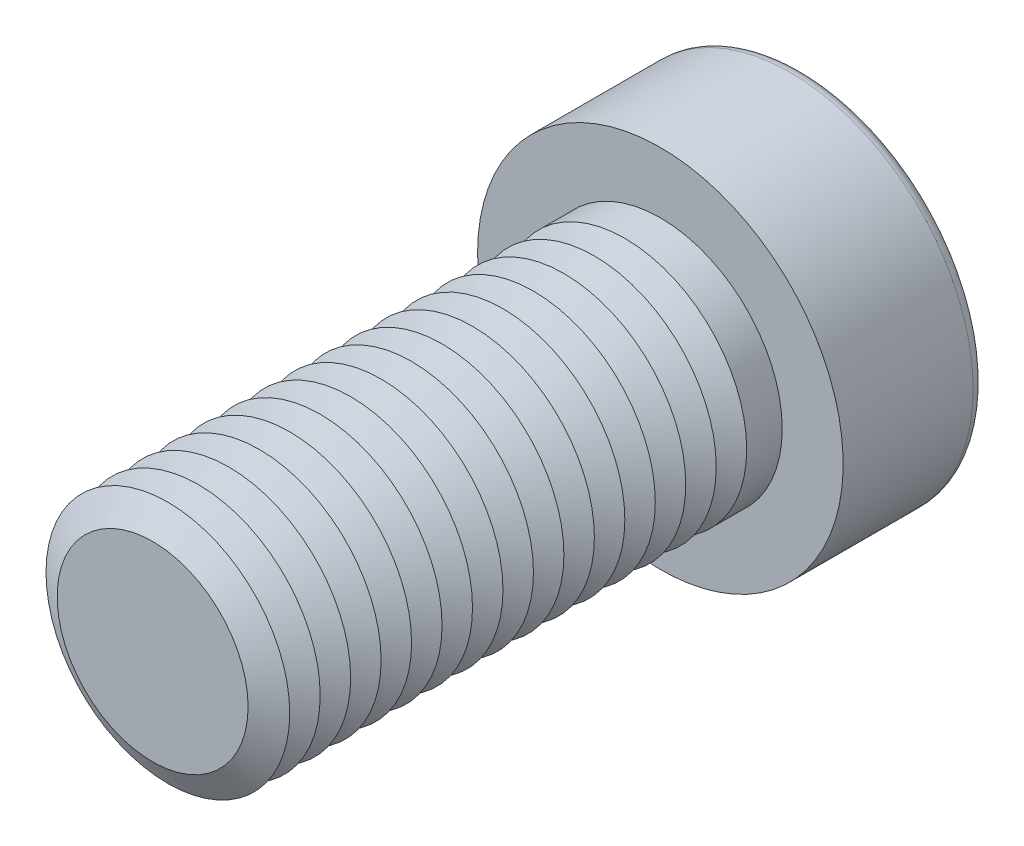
ISO-10303-21;
HEADER;
FILE_DESCRIPTION(('STEP AP214'),'2;1');
FILE_NAME('part.step','',(''),(''),'','','');
FILE_SCHEMA(('AUTOMOTIVE_DESIGN { 1 0 10303 214 1 1 1 1 }'));
ENDSEC;
DATA;
#1=APPLICATION_CONTEXT('core data for automotive mechanical design processes');
#2=APPLICATION_PROTOCOL_DEFINITION('international standard','automotive_design',2000,#1);
#3=PRODUCT_CONTEXT('',#1,'mechanical');
#4=PRODUCT('Part','Part','',(#3));
#5=PRODUCT_RELATED_PRODUCT_CATEGORY('part','',(#4));
#6=PRODUCT_DEFINITION_FORMATION('','',#4);
#7=PRODUCT_DEFINITION_CONTEXT('part definition',#1,'design');
#8=PRODUCT_DEFINITION('design','',#6,#7);
#9=PRODUCT_DEFINITION_SHAPE('','',#8);
#10=(LENGTH_UNIT() NAMED_UNIT(*) SI_UNIT(.MILLI.,.METRE.));
#11=(NAMED_UNIT(*) PLANE_ANGLE_UNIT() SI_UNIT($,.RADIAN.));
#12=(NAMED_UNIT(*) SI_UNIT($,.STERADIAN.) SOLID_ANGLE_UNIT());
#13=UNCERTAINTY_MEASURE_WITH_UNIT(LENGTH_MEASURE(1.E-05),#10,'distance_accuracy_value','');
#14=(GEOMETRIC_REPRESENTATION_CONTEXT(3) GLOBAL_UNCERTAINTY_ASSIGNED_CONTEXT((#13)) GLOBAL_UNIT_ASSIGNED_CONTEXT((#10,
#11,#12)) REPRESENTATION_CONTEXT('',''));
#15=CARTESIAN_POINT('',(0.,0.,0.));
#16=DIRECTION('',(0.,0.,1.));
#17=DIRECTION('',(1.,0.,0.));
#18=AXIS2_PLACEMENT_3D('',#15,#16,#17);
#19=CARTESIAN_POINT('',(0.,0.,39.5));
#20=DIRECTION('',(0.,0.,1.));
#21=DIRECTION('',(1.,0.,0.));
#22=AXIS2_PLACEMENT_3D('',#19,#20,#21);
#23=CONICAL_SURFACE('',#22,12.,1.0471975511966);
#24=CARTESIAN_POINT('',(0.,0.,38.));
#25=DIRECTION('',(0.,0.,1.));
#26=DIRECTION('',(1.,0.,0.));
#27=AXIS2_PLACEMENT_3D('',#24,#25,#26);
#28=CIRCLE('',#27,9.40192378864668);
#29=CARTESIAN_POINT('',(9.40192378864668,0.,38.));
#30=VERTEX_POINT('',#29);
#31=EDGE_CURVE('E314',#30,#30,#28,.T.);
#32=ORIENTED_EDGE('',*,*,#31,.T.);
#33=EDGE_LOOP('',(#32));
#34=FACE_BOUND('',#33,.T.);
#35=CARTESIAN_POINT('',(0.,0.,39.5));
#36=DIRECTION('',(0.,0.,1.));
#37=DIRECTION('',(1.,0.,0.));
#38=AXIS2_PLACEMENT_3D('',#35,#36,#37);
#39=CIRCLE('',#38,12.);
#40=CARTESIAN_POINT('',(12.,0.,39.5));
#41=VERTEX_POINT('',#40);
#42=EDGE_CURVE('E317',#41,#41,#39,.T.);
#43=ORIENTED_EDGE('',*,*,#42,.F.);
#44=EDGE_LOOP('',(#43));
#45=FACE_BOUND('',#44,.T.);
#46=ADVANCED_FACE('F39',(#34,#45),#23,.T.);
#47=CARTESIAN_POINT('',(0.,0.,38.));
#48=DIRECTION('',(0.,0.,-1.));
#49=DIRECTION('',(-1.,0.,0.));
#50=AXIS2_PLACEMENT_3D('',#47,#48,#49);
#51=CONICAL_SURFACE('',#50,9.40192378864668,1.0471975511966);
#52=CARTESIAN_POINT('',(0.,0.,36.5));
#53=DIRECTION('',(0.,0.,1.));
#54=DIRECTION('',(1.,0.,0.));
#55=AXIS2_PLACEMENT_3D('',#52,#53,#54);
#56=CIRCLE('',#55,12.);
#57=CARTESIAN_POINT('',(12.,0.,36.5));
#58=VERTEX_POINT('',#57);
#59=EDGE_CURVE('E325',#58,#58,#56,.T.);
#60=ORIENTED_EDGE('',*,*,#59,.T.);
#61=EDGE_LOOP('',(#60));
#62=FACE_BOUND('',#61,.T.);
#63=ORIENTED_EDGE('',*,*,#31,.F.);
#64=EDGE_LOOP('',(#63));
#65=FACE_BOUND('',#64,.T.);
#66=ADVANCED_FACE('F245',(#62,#65),#51,.T.);
#67=CARTESIAN_POINT('',(0.,0.,50.));
#68=DIRECTION('',(0.,0.,1.));
#69=DIRECTION('',(1.,0.,0.));
#70=AXIS2_PLACEMENT_3D('',#67,#68,#69);
#71=PLANE('',#70);
#72=CARTESIAN_POINT('',(0.,0.,50.));
#73=DIRECTION('',(0.,0.,1.));
#74=DIRECTION('',(1.,0.,0.));
#75=AXIS2_PLACEMENT_3D('',#72,#73,#74);
#76=CIRCLE('',#75,9.40192378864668);
#77=CARTESIAN_POINT('',(9.40192378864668,0.,50.));
#78=VERTEX_POINT('',#77);
#79=EDGE_CURVE('E174',#78,#78,#76,.T.);
#80=ORIENTED_EDGE('',*,*,#79,.T.);
#81=EDGE_LOOP('',(#80));
#82=FACE_BOUND('',#81,.T.);
#83=ADVANCED_FACE('F251',(#82),#71,.T.);
#84=CARTESIAN_POINT('',(0.,0.,50.));
#85=DIRECTION('',(0.,0.,-1.));
#86=DIRECTION('',(-1.,0.,0.));
#87=AXIS2_PLACEMENT_3D('',#84,#85,#86);
#88=CONICAL_SURFACE('',#87,9.40192378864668,1.0471975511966);
#89=CARTESIAN_POINT('',(0.,0.,48.5));
#90=DIRECTION('',(0.,0.,1.));
#91=DIRECTION('',(1.,0.,0.));
#92=AXIS2_PLACEMENT_3D('',#89,#90,#91);
#93=CIRCLE('',#92,12.);
#94=CARTESIAN_POINT('',(12.,0.,48.5));
#95=VERTEX_POINT('',#94);
#96=EDGE_CURVE('E291',#95,#95,#93,.T.);
#97=ORIENTED_EDGE('',*,*,#96,.T.);
#98=EDGE_LOOP('',(#97));
#99=FACE_BOUND('',#98,.T.);
#100=ORIENTED_EDGE('',*,*,#79,.F.);
#101=EDGE_LOOP('',(#100));
#102=FACE_BOUND('',#101,.T.);
#103=ADVANCED_FACE('F199',(#99,#102),#88,.T.);
#104=CARTESIAN_POINT('',(0.,0.,48.5));
#105=DIRECTION('',(0.,0.,1.));
#106=DIRECTION('',(1.,0.,0.));
#107=AXIS2_PLACEMENT_3D('',#104,#105,#106);
#108=CONICAL_SURFACE('',#107,12.,1.0471975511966);
#109=CARTESIAN_POINT('',(0.,0.,47.));
#110=DIRECTION('',(0.,0.,1.));
#111=DIRECTION('',(1.,0.,0.));
#112=AXIS2_PLACEMENT_3D('',#109,#110,#111);
#113=CIRCLE('',#112,9.40192378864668);
#114=CARTESIAN_POINT('',(9.40192378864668,0.,47.));
#115=VERTEX_POINT('',#114);
#116=EDGE_CURVE('E288',#115,#115,#113,.T.);
#117=ORIENTED_EDGE('',*,*,#116,.T.);
#118=EDGE_LOOP('',(#117));
#119=FACE_BOUND('',#118,.T.);
#120=ORIENTED_EDGE('',*,*,#96,.F.);
#121=EDGE_LOOP('',(#120));
#122=FACE_BOUND('',#121,.T.);
#123=ADVANCED_FACE('F277',(#119,#122),#108,.T.);
#124=CARTESIAN_POINT('',(0.,0.,47.));
#125=DIRECTION('',(0.,0.,-1.));
#126=DIRECTION('',(-1.,0.,0.));
#127=AXIS2_PLACEMENT_3D('',#124,#125,#126);
#128=CONICAL_SURFACE('',#127,9.40192378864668,1.0471975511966);
#129=CARTESIAN_POINT('',(0.,0.,45.5));
#130=DIRECTION('',(0.,0.,1.));
#131=DIRECTION('',(1.,0.,0.));
#132=AXIS2_PLACEMENT_3D('',#129,#130,#131);
#133=CIRCLE('',#132,12.);
#134=CARTESIAN_POINT('',(12.,0.,45.5));
#135=VERTEX_POINT('',#134);
#136=EDGE_CURVE('E300',#135,#135,#133,.T.);
#137=ORIENTED_EDGE('',*,*,#136,.T.);
#138=EDGE_LOOP('',(#137));
#139=FACE_BOUND('',#138,.T.);
#140=ORIENTED_EDGE('',*,*,#116,.F.);
#141=EDGE_LOOP('',(#140));
#142=FACE_BOUND('',#141,.T.);
#143=ADVANCED_FACE('F274',(#139,#142),#128,.T.);
#144=CARTESIAN_POINT('',(0.,0.,45.5));
#145=DIRECTION('',(0.,0.,1.));
#146=DIRECTION('',(1.,0.,0.));
#147=AXIS2_PLACEMENT_3D('',#144,#145,#146);
#148=CONICAL_SURFACE('',#147,12.,1.0471975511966);
#149=CARTESIAN_POINT('',(0.,0.,44.));
#150=DIRECTION('',(0.,0.,1.));
#151=DIRECTION('',(1.,0.,0.));
#152=AXIS2_PLACEMENT_3D('',#149,#150,#151);
#153=CIRCLE('',#152,9.40192378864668);
#154=CARTESIAN_POINT('',(9.40192378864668,0.,44.));
#155=VERTEX_POINT('',#154);
#156=EDGE_CURVE('E293',#155,#155,#153,.T.);
#157=ORIENTED_EDGE('',*,*,#156,.T.);
#158=EDGE_LOOP('',(#157));
#159=FACE_BOUND('',#158,.T.);
#160=ORIENTED_EDGE('',*,*,#136,.F.);
#161=EDGE_LOOP('',(#160));
#162=FACE_BOUND('',#161,.T.);
#163=ADVANCED_FACE('F270',(#159,#162),#148,.T.);
#164=CARTESIAN_POINT('',(0.,0.,44.));
#165=DIRECTION('',(0.,0.,-1.));
#166=DIRECTION('',(-1.,0.,0.));
#167=AXIS2_PLACEMENT_3D('',#164,#165,#166);
#168=CONICAL_SURFACE('',#167,9.40192378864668,1.0471975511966);
#169=CARTESIAN_POINT('',(0.,0.,42.5));
#170=DIRECTION('',(0.,0.,1.));
#171=DIRECTION('',(1.,0.,0.));
#172=AXIS2_PLACEMENT_3D('',#169,#170,#171);
#173=CIRCLE('',#172,12.);
#174=CARTESIAN_POINT('',(12.,0.,42.5));
#175=VERTEX_POINT('',#174);
#176=EDGE_CURVE('E310',#175,#175,#173,.T.);
#177=ORIENTED_EDGE('',*,*,#176,.T.);
#178=EDGE_LOOP('',(#177));
#179=FACE_BOUND('',#178,.T.);
#180=ORIENTED_EDGE('',*,*,#156,.F.);
#181=EDGE_LOOP('',(#180));
#182=FACE_BOUND('',#181,.T.);
#183=ADVANCED_FACE('F266',(#179,#182),#168,.T.);
#184=CARTESIAN_POINT('',(0.,0.,42.5));
#185=DIRECTION('',(0.,0.,1.));
#186=DIRECTION('',(1.,0.,0.));
#187=AXIS2_PLACEMENT_3D('',#184,#185,#186);
#188=CONICAL_SURFACE('',#187,12.,1.0471975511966);
#189=CARTESIAN_POINT('',(0.,0.,41.));
#190=DIRECTION('',(0.,0.,1.));
#191=DIRECTION('',(1.,0.,0.));
#192=AXIS2_PLACEMENT_3D('',#189,#190,#191);
#193=CIRCLE('',#192,9.40192378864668);
#194=CARTESIAN_POINT('',(9.40192378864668,0.,41.));
#195=VERTEX_POINT('',#194);
#196=EDGE_CURVE('E306',#195,#195,#193,.T.);
#197=ORIENTED_EDGE('',*,*,#196,.T.);
#198=EDGE_LOOP('',(#197));
#199=FACE_BOUND('',#198,.T.);
#200=ORIENTED_EDGE('',*,*,#176,.F.);
#201=EDGE_LOOP('',(#200));
#202=FACE_BOUND('',#201,.T.);
#203=ADVANCED_FACE('F262',(#199,#202),#188,.T.);
#204=CARTESIAN_POINT('',(0.,0.,41.));
#205=DIRECTION('',(0.,0.,-1.));
#206=DIRECTION('',(-1.,0.,0.));
#207=AXIS2_PLACEMENT_3D('',#204,#205,#206);
#208=CONICAL_SURFACE('',#207,9.40192378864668,1.0471975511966);
#209=ORIENTED_EDGE('',*,*,#42,.T.);
#210=EDGE_LOOP('',(#209));
#211=FACE_BOUND('',#210,.T.);
#212=ORIENTED_EDGE('',*,*,#196,.F.);
#213=EDGE_LOOP('',(#212));
#214=FACE_BOUND('',#213,.T.);
#215=ADVANCED_FACE('F258',(#211,#214),#208,.T.);
#216=CARTESIAN_POINT('',(0.,0.,36.5));
#217=DIRECTION('',(0.,0.,1.));
#218=DIRECTION('',(1.,0.,0.));
#219=AXIS2_PLACEMENT_3D('',#216,#217,#218);
#220=CONICAL_SURFACE('',#219,12.,1.0471975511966);
#221=CARTESIAN_POINT('',(0.,0.,35.));
#222=DIRECTION('',(0.,0.,1.));
#223=DIRECTION('',(1.,0.,0.));
#224=AXIS2_PLACEMENT_3D('',#221,#222,#223);
#225=CIRCLE('',#224,9.40192378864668);
#226=CARTESIAN_POINT('',(9.40192378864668,0.,35.));
#227=VERTEX_POINT('',#226);
#228=EDGE_CURVE('E321',#227,#227,#225,.T.);
#229=ORIENTED_EDGE('',*,*,#228,.T.);
#230=EDGE_LOOP('',(#229));
#231=FACE_BOUND('',#230,.T.);
#232=ORIENTED_EDGE('',*,*,#59,.F.);
#233=EDGE_LOOP('',(#232));
#234=FACE_BOUND('',#233,.T.);
#235=ADVANCED_FACE('F261',(#231,#234),#220,.T.);
#236=CARTESIAN_POINT('',(0.,0.,35.));
#237=DIRECTION('',(0.,0.,-1.));
#238=DIRECTION('',(-1.,0.,0.));
#239=AXIS2_PLACEMENT_3D('',#236,#237,#238);
#240=CONICAL_SURFACE('',#239,9.40192378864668,1.0471975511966);
#241=CARTESIAN_POINT('',(0.,0.,33.5));
#242=DIRECTION('',(0.,0.,1.));
#243=DIRECTION('',(1.,0.,0.));
#244=AXIS2_PLACEMENT_3D('',#241,#242,#243);
#245=CIRCLE('',#244,12.);
#246=CARTESIAN_POINT('',(12.,0.,33.5));
#247=VERTEX_POINT('',#246);
#248=EDGE_CURVE('E333',#247,#247,#245,.T.);
#249=ORIENTED_EDGE('',*,*,#248,.T.);
#250=EDGE_LOOP('',(#249));
#251=FACE_BOUND('',#250,.T.);
#252=ORIENTED_EDGE('',*,*,#228,.F.);
#253=EDGE_LOOP('',(#252));
#254=FACE_BOUND('',#253,.T.);
#255=ADVANCED_FACE('F498',(#251,#254),#240,.T.);
#256=CARTESIAN_POINT('',(0.,0.,33.5));
#257=DIRECTION('',(0.,0.,1.));
#258=DIRECTION('',(1.,0.,0.));
#259=AXIS2_PLACEMENT_3D('',#256,#257,#258);
#260=CONICAL_SURFACE('',#259,12.,1.0471975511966);
#261=CARTESIAN_POINT('',(0.,0.,32.));
#262=DIRECTION('',(0.,0.,1.));
#263=DIRECTION('',(1.,0.,0.));
#264=AXIS2_PLACEMENT_3D('',#261,#262,#263);
#265=CIRCLE('',#264,9.40192378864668);
#266=CARTESIAN_POINT('',(9.40192378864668,0.,32.));
#267=VERTEX_POINT('',#266);
#268=EDGE_CURVE('E329',#267,#267,#265,.T.);
#269=ORIENTED_EDGE('',*,*,#268,.T.);
#270=EDGE_LOOP('',(#269));
#271=FACE_BOUND('',#270,.T.);
#272=ORIENTED_EDGE('',*,*,#248,.F.);
#273=EDGE_LOOP('',(#272));
#274=FACE_BOUND('',#273,.T.);
#275=ADVANCED_FACE('F494',(#271,#274),#260,.T.);
#276=CARTESIAN_POINT('',(0.,0.,32.));
#277=DIRECTION('',(0.,0.,-1.));
#278=DIRECTION('',(-1.,0.,0.));
#279=AXIS2_PLACEMENT_3D('',#276,#277,#278);
#280=CONICAL_SURFACE('',#279,9.40192378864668,1.0471975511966);
#281=CARTESIAN_POINT('',(0.,0.,30.5));
#282=DIRECTION('',(0.,0.,1.));
#283=DIRECTION('',(1.,0.,0.));
#284=AXIS2_PLACEMENT_3D('',#281,#282,#283);
#285=CIRCLE('',#284,12.);
#286=CARTESIAN_POINT('',(12.,0.,30.5));
#287=VERTEX_POINT('',#286);
#288=EDGE_CURVE('E341',#287,#287,#285,.T.);
#289=ORIENTED_EDGE('',*,*,#288,.T.);
#290=EDGE_LOOP('',(#289));
#291=FACE_BOUND('',#290,.T.);
#292=ORIENTED_EDGE('',*,*,#268,.F.);
#293=EDGE_LOOP('',(#292));
#294=FACE_BOUND('',#293,.T.);
#295=ADVANCED_FACE('F490',(#291,#294),#280,.T.);
#296=CARTESIAN_POINT('',(0.,0.,30.5));
#297=DIRECTION('',(0.,0.,1.));
#298=DIRECTION('',(1.,0.,0.));
#299=AXIS2_PLACEMENT_3D('',#296,#297,#298);
#300=CONICAL_SURFACE('',#299,12.,1.0471975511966);
#301=CARTESIAN_POINT('',(0.,0.,29.));
#302=DIRECTION('',(0.,0.,1.));
#303=DIRECTION('',(1.,0.,0.));
#304=AXIS2_PLACEMENT_3D('',#301,#302,#303);
#305=CIRCLE('',#304,9.40192378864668);
#306=CARTESIAN_POINT('',(9.40192378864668,0.,29.));
#307=VERTEX_POINT('',#306);
#308=EDGE_CURVE('E337',#307,#307,#305,.T.);
#309=ORIENTED_EDGE('',*,*,#308,.T.);
#310=EDGE_LOOP('',(#309));
#311=FACE_BOUND('',#310,.T.);
#312=ORIENTED_EDGE('',*,*,#288,.F.);
#313=EDGE_LOOP('',(#312));
#314=FACE_BOUND('',#313,.T.);
#315=ADVANCED_FACE('F486',(#311,#314),#300,.T.);
#316=CARTESIAN_POINT('',(0.,0.,29.));
#317=DIRECTION('',(0.,0.,-1.));
#318=DIRECTION('',(-1.,0.,0.));
#319=AXIS2_PLACEMENT_3D('',#316,#317,#318);
#320=CONICAL_SURFACE('',#319,9.40192378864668,1.0471975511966);
#321=CARTESIAN_POINT('',(0.,0.,27.5));
#322=DIRECTION('',(0.,0.,1.));
#323=DIRECTION('',(1.,0.,0.));
#324=AXIS2_PLACEMENT_3D('',#321,#322,#323);
#325=CIRCLE('',#324,12.);
#326=CARTESIAN_POINT('',(12.,0.,27.5));
#327=VERTEX_POINT('',#326);
#328=EDGE_CURVE('E349',#327,#327,#325,.T.);
#329=ORIENTED_EDGE('',*,*,#328,.T.);
#330=EDGE_LOOP('',(#329));
#331=FACE_BOUND('',#330,.T.);
#332=ORIENTED_EDGE('',*,*,#308,.F.);
#333=EDGE_LOOP('',(#332));
#334=FACE_BOUND('',#333,.T.);
#335=ADVANCED_FACE('F482',(#331,#334),#320,.T.);
#336=CARTESIAN_POINT('',(0.,0.,27.5));
#337=DIRECTION('',(0.,0.,1.));
#338=DIRECTION('',(1.,0.,0.));
#339=AXIS2_PLACEMENT_3D('',#336,#337,#338);
#340=CONICAL_SURFACE('',#339,12.,1.0471975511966);
#341=CARTESIAN_POINT('',(0.,0.,26.));
#342=DIRECTION('',(0.,0.,1.));
#343=DIRECTION('',(1.,0.,0.));
#344=AXIS2_PLACEMENT_3D('',#341,#342,#343);
#345=CIRCLE('',#344,9.40192378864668);
#346=CARTESIAN_POINT('',(9.40192378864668,0.,26.));
#347=VERTEX_POINT('',#346);
#348=EDGE_CURVE('E345',#347,#347,#345,.T.);
#349=ORIENTED_EDGE('',*,*,#348,.T.);
#350=EDGE_LOOP('',(#349));
#351=FACE_BOUND('',#350,.T.);
#352=ORIENTED_EDGE('',*,*,#328,.F.);
#353=EDGE_LOOP('',(#352));
#354=FACE_BOUND('',#353,.T.);
#355=ADVANCED_FACE('F478',(#351,#354),#340,.T.);
#356=CARTESIAN_POINT('',(0.,0.,26.));
#357=DIRECTION('',(0.,0.,-1.));
#358=DIRECTION('',(-1.,0.,0.));
#359=AXIS2_PLACEMENT_3D('',#356,#357,#358);
#360=CONICAL_SURFACE('',#359,9.40192378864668,1.0471975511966);
#361=CARTESIAN_POINT('',(0.,0.,24.5));
#362=DIRECTION('',(0.,0.,1.));
#363=DIRECTION('',(1.,0.,0.));
#364=AXIS2_PLACEMENT_3D('',#361,#362,#363);
#365=CIRCLE('',#364,12.);
#366=CARTESIAN_POINT('',(12.,0.,24.5));
#367=VERTEX_POINT('',#366);
#368=EDGE_CURVE('E357',#367,#367,#365,.T.);
#369=ORIENTED_EDGE('',*,*,#368,.T.);
#370=EDGE_LOOP('',(#369));
#371=FACE_BOUND('',#370,.T.);
#372=ORIENTED_EDGE('',*,*,#348,.F.);
#373=EDGE_LOOP('',(#372));
#374=FACE_BOUND('',#373,.T.);
#375=ADVANCED_FACE('F474',(#371,#374),#360,.T.);
#376=CARTESIAN_POINT('',(0.,0.,24.5));
#377=DIRECTION('',(0.,0.,1.));
#378=DIRECTION('',(1.,0.,0.));
#379=AXIS2_PLACEMENT_3D('',#376,#377,#378);
#380=CONICAL_SURFACE('',#379,12.,1.0471975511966);
#381=CARTESIAN_POINT('',(0.,0.,23.));
#382=DIRECTION('',(0.,0.,1.));
#383=DIRECTION('',(1.,0.,0.));
#384=AXIS2_PLACEMENT_3D('',#381,#382,#383);
#385=CIRCLE('',#384,9.40192378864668);
#386=CARTESIAN_POINT('',(9.40192378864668,0.,23.));
#387=VERTEX_POINT('',#386);
#388=EDGE_CURVE('E353',#387,#387,#385,.T.);
#389=ORIENTED_EDGE('',*,*,#388,.T.);
#390=EDGE_LOOP('',(#389));
#391=FACE_BOUND('',#390,.T.);
#392=ORIENTED_EDGE('',*,*,#368,.F.);
#393=EDGE_LOOP('',(#392));
#394=FACE_BOUND('',#393,.T.);
#395=ADVANCED_FACE('F470',(#391,#394),#380,.T.);
#396=CARTESIAN_POINT('',(0.,0.,23.));
#397=DIRECTION('',(0.,0.,-1.));
#398=DIRECTION('',(-1.,0.,0.));
#399=AXIS2_PLACEMENT_3D('',#396,#397,#398);
#400=CONICAL_SURFACE('',#399,9.40192378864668,1.0471975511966);
#401=CARTESIAN_POINT('',(0.,0.,21.5));
#402=DIRECTION('',(0.,0.,1.));
#403=DIRECTION('',(1.,0.,0.));
#404=AXIS2_PLACEMENT_3D('',#401,#402,#403);
#405=CIRCLE('',#404,12.);
#406=CARTESIAN_POINT('',(12.,0.,21.5));
#407=VERTEX_POINT('',#406);
#408=EDGE_CURVE('E365',#407,#407,#405,.T.);
#409=ORIENTED_EDGE('',*,*,#408,.T.);
#410=EDGE_LOOP('',(#409));
#411=FACE_BOUND('',#410,.T.);
#412=ORIENTED_EDGE('',*,*,#388,.F.);
#413=EDGE_LOOP('',(#412));
#414=FACE_BOUND('',#413,.T.);
#415=ADVANCED_FACE('F466',(#411,#414),#400,.T.);
#416=CARTESIAN_POINT('',(0.,0.,21.5));
#417=DIRECTION('',(0.,0.,1.));
#418=DIRECTION('',(1.,0.,0.));
#419=AXIS2_PLACEMENT_3D('',#416,#417,#418);
#420=CONICAL_SURFACE('',#419,12.,1.0471975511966);
#421=CARTESIAN_POINT('',(0.,0.,20.));
#422=DIRECTION('',(0.,0.,1.));
#423=DIRECTION('',(1.,0.,0.));
#424=AXIS2_PLACEMENT_3D('',#421,#422,#423);
#425=CIRCLE('',#424,9.40192378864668);
#426=CARTESIAN_POINT('',(9.40192378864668,0.,20.));
#427=VERTEX_POINT('',#426);
#428=EDGE_CURVE('E361',#427,#427,#425,.T.);
#429=ORIENTED_EDGE('',*,*,#428,.T.);
#430=EDGE_LOOP('',(#429));
#431=FACE_BOUND('',#430,.T.);
#432=ORIENTED_EDGE('',*,*,#408,.F.);
#433=EDGE_LOOP('',(#432));
#434=FACE_BOUND('',#433,.T.);
#435=ADVANCED_FACE('F462',(#431,#434),#420,.T.);
#436=CARTESIAN_POINT('',(0.,0.,20.));
#437=DIRECTION('',(0.,0.,-1.));
#438=DIRECTION('',(-1.,0.,0.));
#439=AXIS2_PLACEMENT_3D('',#436,#437,#438);
#440=CONICAL_SURFACE('',#439,9.40192378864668,1.0471975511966);
#441=CARTESIAN_POINT('',(0.,0.,18.5));
#442=DIRECTION('',(0.,0.,1.));
#443=DIRECTION('',(1.,0.,0.));
#444=AXIS2_PLACEMENT_3D('',#441,#442,#443);
#445=CIRCLE('',#444,12.);
#446=CARTESIAN_POINT('',(12.,0.,18.5));
#447=VERTEX_POINT('',#446);
#448=EDGE_CURVE('E373',#447,#447,#445,.T.);
#449=ORIENTED_EDGE('',*,*,#448,.T.);
#450=EDGE_LOOP('',(#449));
#451=FACE_BOUND('',#450,.T.);
#452=ORIENTED_EDGE('',*,*,#428,.F.);
#453=EDGE_LOOP('',(#452));
#454=FACE_BOUND('',#453,.T.);
#455=ADVANCED_FACE('F458',(#451,#454),#440,.T.);
#456=CARTESIAN_POINT('',(0.,0.,18.5));
#457=DIRECTION('',(0.,0.,1.));
#458=DIRECTION('',(1.,0.,0.));
#459=AXIS2_PLACEMENT_3D('',#456,#457,#458);
#460=CONICAL_SURFACE('',#459,12.,1.0471975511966);
#461=CARTESIAN_POINT('',(0.,0.,17.));
#462=DIRECTION('',(0.,0.,1.));
#463=DIRECTION('',(1.,0.,0.));
#464=AXIS2_PLACEMENT_3D('',#461,#462,#463);
#465=CIRCLE('',#464,9.40192378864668);
#466=CARTESIAN_POINT('',(9.40192378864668,0.,17.));
#467=VERTEX_POINT('',#466);
#468=EDGE_CURVE('E369',#467,#467,#465,.T.);
#469=ORIENTED_EDGE('',*,*,#468,.T.);
#470=EDGE_LOOP('',(#469));
#471=FACE_BOUND('',#470,.T.);
#472=ORIENTED_EDGE('',*,*,#448,.F.);
#473=EDGE_LOOP('',(#472));
#474=FACE_BOUND('',#473,.T.);
#475=ADVANCED_FACE('F454',(#471,#474),#460,.T.);
#476=CARTESIAN_POINT('',(0.,0.,17.));
#477=DIRECTION('',(0.,0.,-1.));
#478=DIRECTION('',(-1.,0.,0.));
#479=AXIS2_PLACEMENT_3D('',#476,#477,#478);
#480=CONICAL_SURFACE('',#479,9.40192378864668,1.0471975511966);
#481=CARTESIAN_POINT('',(0.,0.,15.5));
#482=DIRECTION('',(0.,0.,1.));
#483=DIRECTION('',(1.,0.,0.));
#484=AXIS2_PLACEMENT_3D('',#481,#482,#483);
#485=CIRCLE('',#484,12.);
#486=CARTESIAN_POINT('',(12.,0.,15.5));
#487=VERTEX_POINT('',#486);
#488=EDGE_CURVE('E381',#487,#487,#485,.T.);
#489=ORIENTED_EDGE('',*,*,#488,.T.);
#490=EDGE_LOOP('',(#489));
#491=FACE_BOUND('',#490,.T.);
#492=ORIENTED_EDGE('',*,*,#468,.F.);
#493=EDGE_LOOP('',(#492));
#494=FACE_BOUND('',#493,.T.);
#495=ADVANCED_FACE('F450',(#491,#494),#480,.T.);
#496=CARTESIAN_POINT('',(0.,0.,15.5));
#497=DIRECTION('',(0.,0.,1.));
#498=DIRECTION('',(1.,0.,0.));
#499=AXIS2_PLACEMENT_3D('',#496,#497,#498);
#500=CONICAL_SURFACE('',#499,12.,1.0471975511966);
#501=CARTESIAN_POINT('',(0.,0.,14.));
#502=DIRECTION('',(0.,0.,1.));
#503=DIRECTION('',(1.,0.,0.));
#504=AXIS2_PLACEMENT_3D('',#501,#502,#503);
#505=CIRCLE('',#504,9.40192378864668);
#506=CARTESIAN_POINT('',(9.40192378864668,0.,14.));
#507=VERTEX_POINT('',#506);
#508=EDGE_CURVE('E377',#507,#507,#505,.T.);
#509=ORIENTED_EDGE('',*,*,#508,.T.);
#510=EDGE_LOOP('',(#509));
#511=FACE_BOUND('',#510,.T.);
#512=ORIENTED_EDGE('',*,*,#488,.F.);
#513=EDGE_LOOP('',(#512));
#514=FACE_BOUND('',#513,.T.);
#515=ADVANCED_FACE('F446',(#511,#514),#500,.T.);
#516=CARTESIAN_POINT('',(0.,0.,14.));
#517=DIRECTION('',(0.,0.,-1.));
#518=DIRECTION('',(-1.,0.,0.));
#519=AXIS2_PLACEMENT_3D('',#516,#517,#518);
#520=CONICAL_SURFACE('',#519,9.40192378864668,1.0471975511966);
#521=CARTESIAN_POINT('',(0.,0.,12.5));
#522=DIRECTION('',(0.,0.,1.));
#523=DIRECTION('',(1.,0.,0.));
#524=AXIS2_PLACEMENT_3D('',#521,#522,#523);
#525=CIRCLE('',#524,12.);
#526=CARTESIAN_POINT('',(12.,0.,12.5));
#527=VERTEX_POINT('',#526);
#528=EDGE_CURVE('E389',#527,#527,#525,.T.);
#529=ORIENTED_EDGE('',*,*,#528,.T.);
#530=EDGE_LOOP('',(#529));
#531=FACE_BOUND('',#530,.T.);
#532=ORIENTED_EDGE('',*,*,#508,.F.);
#533=EDGE_LOOP('',(#532));
#534=FACE_BOUND('',#533,.T.);
#535=ADVANCED_FACE('F442',(#531,#534),#520,.T.);
#536=CARTESIAN_POINT('',(0.,0.,12.5));
#537=DIRECTION('',(0.,0.,1.));
#538=DIRECTION('',(1.,0.,0.));
#539=AXIS2_PLACEMENT_3D('',#536,#537,#538);
#540=CONICAL_SURFACE('',#539,12.,1.0471975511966);
#541=CARTESIAN_POINT('',(0.,0.,11.));
#542=DIRECTION('',(0.,0.,1.));
#543=DIRECTION('',(1.,0.,0.));
#544=AXIS2_PLACEMENT_3D('',#541,#542,#543);
#545=CIRCLE('',#544,9.40192378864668);
#546=CARTESIAN_POINT('',(9.40192378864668,0.,11.));
#547=VERTEX_POINT('',#546);
#548=EDGE_CURVE('E385',#547,#547,#545,.T.);
#549=ORIENTED_EDGE('',*,*,#548,.T.);
#550=EDGE_LOOP('',(#549));
#551=FACE_BOUND('',#550,.T.);
#552=ORIENTED_EDGE('',*,*,#528,.F.);
#553=EDGE_LOOP('',(#552));
#554=FACE_BOUND('',#553,.T.);
#555=ADVANCED_FACE('F438',(#551,#554),#540,.T.);
#556=CARTESIAN_POINT('',(0.,0.,11.));
#557=DIRECTION('',(0.,0.,-1.));
#558=DIRECTION('',(-1.,0.,0.));
#559=AXIS2_PLACEMENT_3D('',#556,#557,#558);
#560=CONICAL_SURFACE('',#559,9.40192378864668,1.0471975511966);
#561=CARTESIAN_POINT('',(0.,0.,9.5));
#562=DIRECTION('',(0.,0.,1.));
#563=DIRECTION('',(1.,0.,0.));
#564=AXIS2_PLACEMENT_3D('',#561,#562,#563);
#565=CIRCLE('',#564,12.);
#566=CARTESIAN_POINT('',(12.,0.,9.5));
#567=VERTEX_POINT('',#566);
#568=EDGE_CURVE('E397',#567,#567,#565,.T.);
#569=ORIENTED_EDGE('',*,*,#568,.T.);
#570=EDGE_LOOP('',(#569));
#571=FACE_BOUND('',#570,.T.);
#572=ORIENTED_EDGE('',*,*,#548,.F.);
#573=EDGE_LOOP('',(#572));
#574=FACE_BOUND('',#573,.T.);
#575=ADVANCED_FACE('F434',(#571,#574),#560,.T.);
#576=CARTESIAN_POINT('',(0.,0.,9.5));
#577=DIRECTION('',(0.,0.,1.));
#578=DIRECTION('',(1.,0.,0.));
#579=AXIS2_PLACEMENT_3D('',#576,#577,#578);
#580=CONICAL_SURFACE('',#579,12.,1.0471975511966);
#581=CARTESIAN_POINT('',(0.,0.,8.));
#582=DIRECTION('',(0.,0.,1.));
#583=DIRECTION('',(1.,0.,0.));
#584=AXIS2_PLACEMENT_3D('',#581,#582,#583);
#585=CIRCLE('',#584,9.40192378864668);
#586=CARTESIAN_POINT('',(9.40192378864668,0.,8.));
#587=VERTEX_POINT('',#586);
#588=EDGE_CURVE('E393',#587,#587,#585,.T.);
#589=ORIENTED_EDGE('',*,*,#588,.T.);
#590=EDGE_LOOP('',(#589));
#591=FACE_BOUND('',#590,.T.);
#592=ORIENTED_EDGE('',*,*,#568,.F.);
#593=EDGE_LOOP('',(#592));
#594=FACE_BOUND('',#593,.T.);
#595=ADVANCED_FACE('F429',(#591,#594),#580,.T.);
#596=CARTESIAN_POINT('',(0.,0.,8.));
#597=DIRECTION('',(0.,0.,-1.));
#598=DIRECTION('',(-1.,0.,0.));
#599=AXIS2_PLACEMENT_3D('',#596,#597,#598);
#600=CONICAL_SURFACE('',#599,9.40192378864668,1.0471975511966);
#601=CARTESIAN_POINT('',(0.,0.,6.50000000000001));
#602=DIRECTION('',(0.,0.,1.));
#603=DIRECTION('',(1.,0.,0.));
#604=AXIS2_PLACEMENT_3D('',#601,#602,#603);
#605=CIRCLE('',#604,12.);
#606=CARTESIAN_POINT('',(12.,0.,6.50000000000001));
#607=VERTEX_POINT('',#606);
#608=EDGE_CURVE('E409',#607,#607,#605,.T.);
#609=ORIENTED_EDGE('',*,*,#608,.T.);
#610=EDGE_LOOP('',(#609));
#611=FACE_BOUND('',#610,.T.);
#612=ORIENTED_EDGE('',*,*,#588,.F.);
#613=EDGE_LOOP('',(#612));
#614=FACE_BOUND('',#613,.T.);
#615=ADVANCED_FACE('F415',(#611,#614),#600,.T.);
#616=CARTESIAN_POINT('',(0.,0.,6.50000000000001));
#617=DIRECTION('',(0.,0.,1.));
#618=DIRECTION('',(1.,0.,0.));
#619=AXIS2_PLACEMENT_3D('',#616,#617,#618);
#620=CONICAL_SURFACE('',#619,12.,1.0471975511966);
#621=CARTESIAN_POINT('',(0.,0.,5.));
#622=DIRECTION('',(0.,0.,1.));
#623=DIRECTION('',(1.,0.,0.));
#624=AXIS2_PLACEMENT_3D('',#621,#622,#623);
#625=CIRCLE('',#624,9.40192378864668);
#626=CARTESIAN_POINT('',(9.40192378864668,0.,5.));
#627=VERTEX_POINT('',#626);
#628=EDGE_CURVE('E401',#627,#627,#625,.T.);
#629=ORIENTED_EDGE('',*,*,#628,.T.);
#630=EDGE_LOOP('',(#629));
#631=FACE_BOUND('',#630,.T.);
#632=ORIENTED_EDGE('',*,*,#608,.F.);
#633=EDGE_LOOP('',(#632));
#634=FACE_BOUND('',#633,.T.);
#635=ADVANCED_FACE('F418',(#631,#634),#620,.T.);
#636=CARTESIAN_POINT('',(0.,0.,5.));
#637=DIRECTION('',(0.,0.,-1.));
#638=DIRECTION('',(-1.,0.,0.));
#639=AXIS2_PLACEMENT_3D('',#636,#637,#638);
#640=CONICAL_SURFACE('',#639,9.40192378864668,1.0471975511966);
#641=CARTESIAN_POINT('',(0.,0.,3.5));
#642=DIRECTION('',(0.,0.,1.));
#643=DIRECTION('',(1.,0.,0.));
#644=AXIS2_PLACEMENT_3D('',#641,#642,#643);
#645=CIRCLE('',#644,12.);
#646=CARTESIAN_POINT('',(12.,0.,3.5));
#647=VERTEX_POINT('',#646);
#648=EDGE_CURVE('E405',#647,#647,#645,.T.);
#649=ORIENTED_EDGE('',*,*,#648,.T.);
#650=EDGE_LOOP('',(#649));
#651=FACE_BOUND('',#650,.T.);
#652=ORIENTED_EDGE('',*,*,#628,.F.);
#653=EDGE_LOOP('',(#652));
#654=FACE_BOUND('',#653,.T.);
#655=ADVANCED_FACE('F420',(#651,#654),#640,.T.);
#656=CARTESIAN_POINT('',(0.,0.,0.25));
#657=DIRECTION('',(0.,0.,-1.));
#658=DIRECTION('',(-1.,0.,0.));
#659=AXIS2_PLACEMENT_3D('',#656,#657,#658);
#660=CONICAL_SURFACE('',#659,9.5,1.0471975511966);
#661=CARTESIAN_POINT('',(0.,0.,5.73482755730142));
#662=VERTEX_POINT('',#661);
#663=VERTEX_LOOP('',#662);
#664=FACE_BOUND('',#663,.T.);
#665=CARTESIAN_POINT('',(0.,0.,0.25));
#666=DIRECTION('',(0.,0.,-1.));
#667=DIRECTION('',(-1.,0.,0.));
#668=AXIS2_PLACEMENT_3D('',#665,#666,#667);
#669=CIRCLE('',#668,9.5);
#670=CARTESIAN_POINT('',(-8.22724133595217,4.75,0.25));
#671=VERTEX_POINT('',#670);
#672=CARTESIAN_POINT('',(0.,9.5,0.25));
#673=VERTEX_POINT('',#672);
#674=EDGE_CURVE('E149',#671,#673,#669,.T.);
#675=ORIENTED_EDGE('',*,*,#674,.T.);
#676=CARTESIAN_POINT('',(0.,0.,0.25));
#677=DIRECTION('',(0.,0.,-1.));
#678=DIRECTION('',(-1.,0.,0.));
#679=AXIS2_PLACEMENT_3D('',#676,#677,#678);
#680=CIRCLE('',#679,9.5);
#681=CARTESIAN_POINT('',(8.22724133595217,4.75,0.25));
#682=VERTEX_POINT('',#681);
#683=EDGE_CURVE('E54',#673,#682,#680,.T.);
#684=ORIENTED_EDGE('',*,*,#683,.T.);
#685=CARTESIAN_POINT('',(8.22724133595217,-4.75,0.25));
#686=VERTEX_POINT('',#685);
#687=EDGE_CURVE('E998',#682,#686,#680,.T.);
#688=ORIENTED_EDGE('',*,*,#687,.T.);
#689=CARTESIAN_POINT('',(0.,-9.5,0.25));
#690=VERTEX_POINT('',#689);
#691=EDGE_CURVE('E997',#686,#690,#680,.T.);
#692=ORIENTED_EDGE('',*,*,#691,.T.);
#693=CARTESIAN_POINT('',(-8.22724133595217,-4.75,0.25));
#694=VERTEX_POINT('',#693);
#695=EDGE_CURVE('E992',#690,#694,#680,.T.);
#696=ORIENTED_EDGE('',*,*,#695,.T.);
#697=EDGE_CURVE('E990',#694,#671,#680,.T.);
#698=ORIENTED_EDGE('',*,*,#697,.T.);
#699=EDGE_LOOP('',(#675,#684,#688,#692,#696,#698));
#700=FACE_BOUND('',#699,.T.);
#701=ADVANCED_FACE('F201',(#664,#700),#660,.F.);
#702=CARTESIAN_POINT('',(0.,0.,0.25));
#703=DIRECTION('',(0.,0.,-1.));
#704=DIRECTION('',(-1.,0.,0.));
#705=AXIS2_PLACEMENT_3D('',#702,#703,#704);
#706=PLANE('',#705);
#707=ORIENTED_EDGE('',*,*,#683,.F.);
#708=DIRECTION('',(1.,0.,0.));
#709=VECTOR('',#708,1.);
#710=CARTESIAN_POINT('',(-5.48482755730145,9.5,0.25));
#711=LINE('',#710,#709);
#712=CARTESIAN_POINT('',(5.48482755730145,9.5,0.25));
#713=VERTEX_POINT('',#712);
#714=EDGE_CURVE('E1036',#673,#713,#711,.T.);
#715=ORIENTED_EDGE('',*,*,#714,.T.);
#716=DIRECTION('',(0.5,-0.866025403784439,0.));
#717=VECTOR('',#716,1.);
#718=CARTESIAN_POINT('',(5.48482755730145,9.5,0.25));
#719=LINE('',#718,#717);
#720=EDGE_CURVE('E155',#713,#682,#719,.T.);
#721=ORIENTED_EDGE('',*,*,#720,.T.);
#722=EDGE_LOOP('',(#707,#715,#721));
#723=FACE_BOUND('',#722,.T.);
#724=ADVANCED_FACE('F587',(#723),#706,.T.);
#725=ORIENTED_EDGE('',*,*,#687,.F.);
#726=CARTESIAN_POINT('',(10.9696551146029,0.,0.25));
#727=VERTEX_POINT('',#726);
#728=EDGE_CURVE('E1035',#682,#727,#719,.T.);
#729=ORIENTED_EDGE('',*,*,#728,.T.);
#730=DIRECTION('',(-0.5,-0.866025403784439,0.));
#731=VECTOR('',#730,1.);
#732=CARTESIAN_POINT('',(10.9696551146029,0.,0.25));
#733=LINE('',#732,#731);
#734=EDGE_CURVE('E1009',#727,#686,#733,.T.);
#735=ORIENTED_EDGE('',*,*,#734,.T.);
#736=EDGE_LOOP('',(#725,#729,#735));
#737=FACE_BOUND('',#736,.T.);
#738=ADVANCED_FACE('F597',(#737),#706,.T.);
#739=ORIENTED_EDGE('',*,*,#691,.F.);
#740=CARTESIAN_POINT('',(5.48482755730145,-9.5,0.25));
#741=VERTEX_POINT('',#740);
#742=EDGE_CURVE('E1011',#686,#741,#733,.T.);
#743=ORIENTED_EDGE('',*,*,#742,.T.);
#744=DIRECTION('',(-1.,0.,0.));
#745=VECTOR('',#744,1.);
#746=CARTESIAN_POINT('',(5.48482755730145,-9.5,0.25));
#747=LINE('',#746,#745);
#748=EDGE_CURVE('E964',#741,#690,#747,.T.);
#749=ORIENTED_EDGE('',*,*,#748,.T.);
#750=EDGE_LOOP('',(#739,#743,#749));
#751=FACE_BOUND('',#750,.T.);
#752=ADVANCED_FACE('F607',(#751),#706,.T.);
#753=ORIENTED_EDGE('',*,*,#695,.F.);
#754=CARTESIAN_POINT('',(-5.48482755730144,-9.5,0.25));
#755=VERTEX_POINT('',#754);
#756=EDGE_CURVE('E1005',#690,#755,#747,.T.);
#757=ORIENTED_EDGE('',*,*,#756,.T.);
#758=DIRECTION('',(-0.5,0.866025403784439,0.));
#759=VECTOR('',#758,1.);
#760=CARTESIAN_POINT('',(-5.48482755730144,-9.5,0.25));
#761=LINE('',#760,#759);
#762=EDGE_CURVE('E1007',#755,#694,#761,.T.);
#763=ORIENTED_EDGE('',*,*,#762,.T.);
#764=EDGE_LOOP('',(#753,#757,#763));
#765=FACE_BOUND('',#764,.T.);
#766=ADVANCED_FACE('F615',(#765),#706,.T.);
#767=ORIENTED_EDGE('',*,*,#697,.F.);
#768=CARTESIAN_POINT('',(-10.9696551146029,0.,0.25));
#769=VERTEX_POINT('',#768);
#770=EDGE_CURVE('E1012',#694,#769,#761,.T.);
#771=ORIENTED_EDGE('',*,*,#770,.T.);
#772=DIRECTION('',(0.5,0.866025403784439,0.));
#773=VECTOR('',#772,1.);
#774=CARTESIAN_POINT('',(-10.9696551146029,0.,0.25));
#775=LINE('',#774,#773);
#776=EDGE_CURVE('E158',#769,#671,#775,.T.);
#777=ORIENTED_EDGE('',*,*,#776,.T.);
#778=EDGE_LOOP('',(#767,#771,#777));
#779=FACE_BOUND('',#778,.T.);
#780=ADVANCED_FACE('F231',(#779),#706,.T.);
#781=ORIENTED_EDGE('',*,*,#674,.F.);
#782=CARTESIAN_POINT('',(-5.48482755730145,9.5,0.25));
#783=VERTEX_POINT('',#782);
#784=EDGE_CURVE('E1019',#671,#783,#775,.T.);
#785=ORIENTED_EDGE('',*,*,#784,.T.);
#786=EDGE_CURVE('E1033',#783,#673,#711,.T.);
#787=ORIENTED_EDGE('',*,*,#786,.T.);
#788=EDGE_LOOP('',(#781,#785,#787));
#789=FACE_BOUND('',#788,.T.);
#790=ADVANCED_FACE('F599',(#789),#706,.T.);
#791=CARTESIAN_POINT('',(-5.48482755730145,9.5,0.25));
#792=DIRECTION('',(0.,1.,0.));
#793=DIRECTION('',(0.,0.,1.));
#794=AXIS2_PLACEMENT_3D('',#791,#792,#793);
#795=PLANE('',#794);
#796=DIRECTION('',(0.,0.,-1.));
#797=VECTOR('',#796,1.);
#798=CARTESIAN_POINT('',(-5.48482755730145,9.5,0.25));
#799=LINE('',#798,#797);
#800=CARTESIAN_POINT('',(-5.48482755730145,9.50000000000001,-14.));
#801=VERTEX_POINT('',#800);
#802=EDGE_CURVE('E147',#783,#801,#799,.T.);
#803=ORIENTED_EDGE('',*,*,#802,.T.);
#804=CARTESIAN_POINT('',(-14.3184360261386,9.5,-15.6649552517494));
#805=CARTESIAN_POINT('',(-13.8894653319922,9.5,-15.5692031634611));
#806=CARTESIAN_POINT('',(-13.460220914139,9.5,-15.4746548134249));
#807=CARTESIAN_POINT('',(-12.6010505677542,9.5,-15.2886152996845));
#808=CARTESIAN_POINT('',(-12.1711246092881,9.5,-15.1971242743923));
#809=CARTESIAN_POINT('',(-11.3100507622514,9.5,-15.0177651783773));
#810=CARTESIAN_POINT('',(-10.8789020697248,9.5,-14.9299009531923));
#811=CARTESIAN_POINT('',(-10.0156929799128,9.5,-14.7587741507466));
#812=CARTESIAN_POINT('',(-9.58363259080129,9.5,-14.67551153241));
#813=CARTESIAN_POINT('',(-8.72220045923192,9.5,-14.5153788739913));
#814=CARTESIAN_POINT('',(-8.29283790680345,9.5,-14.4384596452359));
#815=CARTESIAN_POINT('',(-7.43292010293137,9.5,-14.2915458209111));
#816=CARTESIAN_POINT('',(-7.0023648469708,9.5,-14.2215512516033));
#817=CARTESIAN_POINT('',(-6.14001360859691,9.5,-14.0901048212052));
#818=CARTESIAN_POINT('',(-5.70821784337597,9.5,-14.0286515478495));
#819=CARTESIAN_POINT('',(-4.84325961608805,9.5,-13.9161318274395));
#820=CARTESIAN_POINT('',(-4.41009715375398,9.5,-13.8650653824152));
#821=CARTESIAN_POINT('',(-3.53757113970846,9.5,-13.7748018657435));
#822=CARTESIAN_POINT('',(-3.09819281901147,9.5,-13.7357454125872));
#823=CARTESIAN_POINT('',(-2.2183738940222,9.5,-13.6722240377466));
#824=CARTESIAN_POINT('',(-1.77793331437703,9.5,-13.6477587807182));
#825=CARTESIAN_POINT('',(-0.896631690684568,9.5,-13.6148480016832));
#826=CARTESIAN_POINT('',(-0.455770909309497,9.5,-13.606395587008));
#827=CARTESIAN_POINT('',(0.425958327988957,9.5,-13.606024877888));
#828=CARTESIAN_POINT('',(0.86682678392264,9.5,-13.614106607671));
#829=CARTESIAN_POINT('',(1.74977048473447,9.5,-13.6463580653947));
#830=CARTESIAN_POINT('',(2.1918432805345,9.5,-13.6705935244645));
#831=CARTESIAN_POINT('',(3.07492453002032,9.5,-13.7337958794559));
#832=CARTESIAN_POINT('',(3.5159329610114,9.5,-13.7727630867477));
#833=CARTESIAN_POINT('',(4.39689734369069,9.5,-13.8635087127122));
#834=CARTESIAN_POINT('',(4.83685243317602,9.5,-13.9152953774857));
#835=CARTESIAN_POINT('',(5.7153522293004,9.5,-14.0295826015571));
#836=CARTESIAN_POINT('',(6.15389693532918,9.5,-14.0920831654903));
#837=CARTESIAN_POINT('',(7.0410904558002,9.5,-14.2276023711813));
#838=CARTESIAN_POINT('',(7.48970345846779,9.5,-14.3008534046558));
#839=CARTESIAN_POINT('',(8.38565999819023,9.5,-14.4547834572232));
#840=CARTESIAN_POINT('',(8.83300349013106,9.5,-14.5354627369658));
#841=CARTESIAN_POINT('',(9.726628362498,9.5,-14.7027801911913));
#842=CARTESIAN_POINT('',(10.1729095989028,9.5,-14.7894191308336));
#843=CARTESIAN_POINT('',(11.0645098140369,9.5,-14.9674686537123));
#844=CARTESIAN_POINT('',(11.5098288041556,9.5,-15.0588791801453));
#845=CARTESIAN_POINT('',(12.3998049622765,9.5,-15.2455765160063));
#846=CARTESIAN_POINT('',(12.8444618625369,9.5,-15.3408645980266));
#847=CARTESIAN_POINT('',(13.7330947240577,9.5,-15.5345693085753));
#848=CARTESIAN_POINT('',(14.1770706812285,9.5,-15.6329859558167));
#849=CARTESIAN_POINT('',(15.5080689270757,9.5,-15.9320263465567));
#850=CARTESIAN_POINT('',(16.3942355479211,9.5,-16.1364562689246));
#851=CARTESIAN_POINT('',(18.1541693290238,9.5,-16.5497091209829));
#852=CARTESIAN_POINT('',(19.0279562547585,9.5,-16.7584484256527));
#853=CARTESIAN_POINT('',(20.7743818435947,9.5,-17.180754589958));
#854=CARTESIAN_POINT('',(21.6470204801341,9.5,-17.3943215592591));
#855=CARTESIAN_POINT('',(23.3902098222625,9.5,-17.8246823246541));
#856=CARTESIAN_POINT('',(24.2607617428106,9.5,-18.0414712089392));
#857=CARTESIAN_POINT('',(25.5660757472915,9.5,-18.3686360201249));
#858=CARTESIAN_POINT('',(26.0010870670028,9.5,-18.4780192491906));
#859=CARTESIAN_POINT('',(26.8709622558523,9.5,-18.6973688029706));
#860=CARTESIAN_POINT('',(27.3058261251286,9.5,-18.8073351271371));
#861=CARTESIAN_POINT('',(27.7406260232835,9.5,-18.9175537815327));
#862=B_SPLINE_CURVE_WITH_KNOTS('',3,(#804,#805,#806,#807,#808,#809,#810,#811,#812,#813,#814,
#815,#816,#817,#818,#819,#820,#821,#822,#823,#824,#825,#826,#827,#828,#829,#830,#831,#832,#833,
#834,#835,#836,#837,#838,#839,#840,#841,#842,#843,#844,#845,#846,#847,#848,#849,#850,#851,#852,
#853,#854,#855,#856,#857,#858,#859,#860,#861),.UNSPECIFIED.,.F.,.F.,(4,2,2,2,2,2,2,2,2,2,2,2,2,
2,2,2,2,2,2,2,2,2,2,2,2,2,2,2,4),(0.,1.31858776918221,2.63723515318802,3.95724656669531,
5.27724619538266,6.5857950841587,7.89434893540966,9.20268616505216,10.5110236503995,
11.8341427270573,13.1572313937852,14.4797504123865,15.8022713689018,17.1302069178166,
18.4581705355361,19.7869905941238,21.1158112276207,22.4793957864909,23.8430282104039,
25.2068360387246,26.5706276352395,27.9348704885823,29.2991215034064,32.0273967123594,
34.7225025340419,37.4176696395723,40.1090806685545,41.4547385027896,42.8003950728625),.UNSPECIFIED.);
#863=CARTESIAN_POINT('',(5.48482755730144,9.50000000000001,-14.));
#864=VERTEX_POINT('',#863);
#865=EDGE_CURVE('E124',#801,#864,#862,.T.);
#866=ORIENTED_EDGE('',*,*,#865,.T.);
#867=DIRECTION('',(0.,0.,-1.));
#868=VECTOR('',#867,1.);
#869=CARTESIAN_POINT('',(5.48482755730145,9.5,0.25));
#870=LINE('',#869,#868);
#871=EDGE_CURVE('E143',#713,#864,#870,.T.);
#872=ORIENTED_EDGE('',*,*,#871,.F.);
#873=ORIENTED_EDGE('',*,*,#714,.F.);
#874=ORIENTED_EDGE('',*,*,#786,.F.);
#875=EDGE_LOOP('',(#803,#866,#872,#873,#874));
#876=FACE_BOUND('',#875,.T.);
#877=ADVANCED_FACE('F141',(#876),#795,.F.);
#878=CARTESIAN_POINT('',(5.48482755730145,9.5,0.25));
#879=DIRECTION('',(0.866025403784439,0.5,0.));
#880=DIRECTION('',(-0.5,0.866025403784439,0.));
#881=AXIS2_PLACEMENT_3D('',#878,#879,#880);
#882=PLANE('',#881);
#883=ORIENTED_EDGE('',*,*,#871,.T.);
#884=CARTESIAN_POINT('',(5.48471208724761,9.5002,-14.0000309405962));
#885=CARTESIAN_POINT('',(5.71249277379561,9.10567227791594,-13.9389722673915));
#886=CARTESIAN_POINT('',(5.9406864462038,8.71042924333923,-13.8835411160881));
#887=CARTESIAN_POINT('',(6.39787965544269,7.918547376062,-13.7861538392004));
#888=CARTESIAN_POINT('',(6.62687948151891,7.52190804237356,-13.7442031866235));
#889=CARTESIAN_POINT('',(7.084296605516,6.72963834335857,-13.6762259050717));
#890=CARTESIAN_POINT('',(7.31271081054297,6.33401333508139,-13.6501182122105));
#891=CARTESIAN_POINT('',(7.76983049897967,5.54225880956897,-13.6151104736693));
#892=CARTESIAN_POINT('',(7.99853591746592,5.14612940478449,-13.6062070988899));
#893=CARTESIAN_POINT('',(8.45594675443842,4.35387059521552,-13.6062070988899));
#894=CARTESIAN_POINT('',(8.68465217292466,3.95774119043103,-13.6151104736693));
#895=CARTESIAN_POINT('',(9.14177186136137,3.16598666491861,-13.6501182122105));
#896=CARTESIAN_POINT('',(9.37018606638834,2.77036165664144,-13.6762259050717));
#897=CARTESIAN_POINT('',(9.82760319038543,1.97809195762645,-13.7442031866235));
#898=CARTESIAN_POINT('',(10.0566030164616,1.581452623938,-13.7861538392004));
#899=CARTESIAN_POINT('',(10.5137962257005,0.789570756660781,-13.8835411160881));
#900=CARTESIAN_POINT('',(10.7419898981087,0.394327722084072,-13.9389722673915));
#901=CARTESIAN_POINT('',(10.9697705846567,-0.000199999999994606,-14.0000309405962));
#902=B_SPLINE_CURVE_WITH_KNOTS('',3,(#884,#885,#886,#887,#888,#889,#890,#891,#892,#893,#894,
#895,#896,#897,#898,#899,#900,#901),.UNSPECIFIED.,.F.,.F.,(4,2,2,2,2,2,2,2,4),(0.,
1.37897722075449,2.75851359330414,4.13093041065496,5.50308163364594,6.87523285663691,
8.24764967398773,9.62718604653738,11.0061632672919),.UNSPECIFIED.);
#903=CARTESIAN_POINT('',(10.9696551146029,0.,-14.));
#904=VERTEX_POINT('',#903);
#905=EDGE_CURVE('E11',#864,#904,#902,.T.);
#906=ORIENTED_EDGE('',*,*,#905,.T.);
#907=DIRECTION('',(0.,0.,-1.));
#908=VECTOR('',#907,1.);
#909=CARTESIAN_POINT('',(10.9696551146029,0.,0.25));
#910=LINE('',#909,#908);
#911=EDGE_CURVE('E157',#727,#904,#910,.T.);
#912=ORIENTED_EDGE('',*,*,#911,.F.);
#913=ORIENTED_EDGE('',*,*,#728,.F.);
#914=ORIENTED_EDGE('',*,*,#720,.F.);
#915=EDGE_LOOP('',(#883,#906,#912,#913,#914));
#916=FACE_BOUND('',#915,.T.);
#917=ADVANCED_FACE('F152',(#916),#882,.F.);
#918=CARTESIAN_POINT('',(10.9696551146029,0.,0.25));
#919=DIRECTION('',(0.866025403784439,-0.5,0.));
#920=DIRECTION('',(0.5,0.866025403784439,0.));
#921=AXIS2_PLACEMENT_3D('',#918,#919,#920);
#922=PLANE('',#921);
#923=ORIENTED_EDGE('',*,*,#911,.T.);
#924=CARTESIAN_POINT('',(10.9697705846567,0.000200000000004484,-14.0000309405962));
#925=CARTESIAN_POINT('',(10.7419898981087,-0.394327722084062,-13.9389722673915));
#926=CARTESIAN_POINT('',(10.5137962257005,-0.789570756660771,-13.8835411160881));
#927=CARTESIAN_POINT('',(10.0566030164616,-1.581452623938,-13.7861538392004));
#928=CARTESIAN_POINT('',(9.82760319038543,-1.97809195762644,-13.7442031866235));
#929=CARTESIAN_POINT('',(9.37018606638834,-2.77036165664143,-13.6762259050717));
#930=CARTESIAN_POINT('',(9.14177186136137,-3.1659866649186,-13.6501182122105));
#931=CARTESIAN_POINT('',(8.68465217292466,-3.95774119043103,-13.6151104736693));
#932=CARTESIAN_POINT('',(8.45594675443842,-4.35387059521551,-13.6062070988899));
#933=CARTESIAN_POINT('',(7.99853591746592,-5.14612940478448,-13.6062070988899));
#934=CARTESIAN_POINT('',(7.76983049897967,-5.54225880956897,-13.6151104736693));
#935=CARTESIAN_POINT('',(7.31271081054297,-6.33401333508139,-13.6501182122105));
#936=CARTESIAN_POINT('',(7.084296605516,-6.72963834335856,-13.6762259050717));
#937=CARTESIAN_POINT('',(6.62687948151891,-7.52190804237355,-13.7442031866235));
#938=CARTESIAN_POINT('',(6.39787965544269,-7.918547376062,-13.7861538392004));
#939=CARTESIAN_POINT('',(5.9406864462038,-8.71042924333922,-13.8835411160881));
#940=CARTESIAN_POINT('',(5.71249277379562,-9.10567227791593,-13.9389722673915));
#941=CARTESIAN_POINT('',(5.48471208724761,-9.5002,-14.0000309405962));
#942=B_SPLINE_CURVE_WITH_KNOTS('',3,(#924,#925,#926,#927,#928,#929,#930,#931,#932,#933,#934,
#935,#936,#937,#938,#939,#940,#941),.UNSPECIFIED.,.F.,.F.,(4,2,2,2,2,2,2,2,4),(0.,
1.37897722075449,2.75851359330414,4.13093041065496,5.50308163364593,6.87523285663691,
8.24764967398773,9.62718604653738,11.0061632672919),.UNSPECIFIED.);
#943=CARTESIAN_POINT('',(5.48482755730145,-9.50000000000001,-14.));
#944=VERTEX_POINT('',#943);
#945=EDGE_CURVE('E173',#904,#944,#942,.T.);
#946=ORIENTED_EDGE('',*,*,#945,.T.);
#947=DIRECTION('',(0.,0.,-1.));
#948=VECTOR('',#947,1.);
#949=CARTESIAN_POINT('',(5.48482755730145,-9.5,0.25));
#950=LINE('',#949,#948);
#951=EDGE_CURVE('E959',#741,#944,#950,.T.);
#952=ORIENTED_EDGE('',*,*,#951,.F.);
#953=ORIENTED_EDGE('',*,*,#742,.F.);
#954=ORIENTED_EDGE('',*,*,#734,.F.);
#955=EDGE_LOOP('',(#923,#946,#952,#953,#954));
#956=FACE_BOUND('',#955,.T.);
#957=ADVANCED_FACE('F191',(#956),#922,.F.);
#958=CARTESIAN_POINT('',(5.48482755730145,-9.5,0.25));
#959=DIRECTION('',(0.,-1.,0.));
#960=DIRECTION('',(0.,0.,-1.));
#961=AXIS2_PLACEMENT_3D('',#958,#959,#960);
#962=PLANE('',#961);
#963=ORIENTED_EDGE('',*,*,#951,.T.);
#964=CARTESIAN_POINT('',(-14.3184360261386,-9.5,-15.6649552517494));
#965=CARTESIAN_POINT('',(-13.8894653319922,-9.5,-15.5692031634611));
#966=CARTESIAN_POINT('',(-13.460220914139,-9.5,-15.4746548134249));
#967=CARTESIAN_POINT('',(-12.6010505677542,-9.5,-15.2886152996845));
#968=CARTESIAN_POINT('',(-12.1711246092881,-9.5,-15.1971242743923));
#969=CARTESIAN_POINT('',(-11.3100507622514,-9.5,-15.0177651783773));
#970=CARTESIAN_POINT('',(-10.8789020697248,-9.5,-14.9299009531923));
#971=CARTESIAN_POINT('',(-10.0156929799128,-9.5,-14.7587741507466));
#972=CARTESIAN_POINT('',(-9.58363259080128,-9.5,-14.67551153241));
#973=CARTESIAN_POINT('',(-8.72220045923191,-9.5,-14.5153788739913));
#974=CARTESIAN_POINT('',(-8.29283790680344,-9.5,-14.4384596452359));
#975=CARTESIAN_POINT('',(-7.43292010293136,-9.5,-14.2915458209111));
#976=CARTESIAN_POINT('',(-7.00236484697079,-9.5,-14.2215512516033));
#977=CARTESIAN_POINT('',(-6.1400136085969,-9.5,-14.0901048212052));
#978=CARTESIAN_POINT('',(-5.70821784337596,-9.5,-14.0286515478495));
#979=CARTESIAN_POINT('',(-4.84325961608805,-9.5,-13.9161318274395));
#980=CARTESIAN_POINT('',(-4.41009715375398,-9.5,-13.8650653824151));
#981=CARTESIAN_POINT('',(-3.53757113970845,-9.5,-13.7748018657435));
#982=CARTESIAN_POINT('',(-3.09819281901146,-9.5,-13.7357454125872));
#983=CARTESIAN_POINT('',(-2.2183738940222,-9.5,-13.6722240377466));
#984=CARTESIAN_POINT('',(-1.77793331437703,-9.5,-13.6477587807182));
#985=CARTESIAN_POINT('',(-0.896631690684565,-9.5,-13.6148480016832));
#986=CARTESIAN_POINT('',(-0.455770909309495,-9.5,-13.606395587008));
#987=CARTESIAN_POINT('',(0.425958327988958,-9.5,-13.606024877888));
#988=CARTESIAN_POINT('',(0.86682678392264,-9.5,-13.614106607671));
#989=CARTESIAN_POINT('',(1.74977048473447,-9.5,-13.6463580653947));
#990=CARTESIAN_POINT('',(2.1918432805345,-9.5,-13.6705935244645));
#991=CARTESIAN_POINT('',(3.07492453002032,-9.5,-13.7337958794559));
#992=CARTESIAN_POINT('',(3.5159329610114,-9.5,-13.7727630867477));
#993=CARTESIAN_POINT('',(4.39689734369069,-9.5,-13.8635087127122));
#994=CARTESIAN_POINT('',(4.83685243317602,-9.5,-13.9152953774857));
#995=CARTESIAN_POINT('',(5.7153522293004,-9.5,-14.0295826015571));
#996=CARTESIAN_POINT('',(6.15389693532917,-9.5,-14.0920831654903));
#997=CARTESIAN_POINT('',(7.04109045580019,-9.5,-14.2276023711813));
#998=CARTESIAN_POINT('',(7.48970345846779,-9.5,-14.3008534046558));
#999=CARTESIAN_POINT('',(8.38565999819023,-9.5,-14.4547834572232));
#1000=CARTESIAN_POINT('',(8.83300349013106,-9.5,-14.5354627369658));
#1001=CARTESIAN_POINT('',(9.72662836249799,-9.5,-14.7027801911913));
#1002=CARTESIAN_POINT('',(10.1729095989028,-9.5,-14.7894191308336));
#1003=CARTESIAN_POINT('',(11.0645098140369,-9.5,-14.9674686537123));
#1004=CARTESIAN_POINT('',(11.5098288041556,-9.5,-15.0588791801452));
#1005=CARTESIAN_POINT('',(12.3998049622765,-9.5,-15.2455765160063));
#1006=CARTESIAN_POINT('',(12.8444618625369,-9.5,-15.3408645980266));
#1007=CARTESIAN_POINT('',(13.7330947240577,-9.5,-15.5345693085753));
#1008=CARTESIAN_POINT('',(14.1770706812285,-9.5,-15.6329859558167));
#1009=CARTESIAN_POINT('',(15.5080689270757,-9.5,-15.9320263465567));
#1010=CARTESIAN_POINT('',(16.3942355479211,-9.5,-16.1364562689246));
#1011=CARTESIAN_POINT('',(18.1541693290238,-9.5,-16.5497091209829));
#1012=CARTESIAN_POINT('',(19.0279562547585,-9.5,-16.7584484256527));
#1013=CARTESIAN_POINT('',(20.7743818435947,-9.5,-17.180754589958));
#1014=CARTESIAN_POINT('',(21.647020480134,-9.5,-17.3943215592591));
#1015=CARTESIAN_POINT('',(23.3902098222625,-9.5,-17.8246823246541));
#1016=CARTESIAN_POINT('',(24.2607617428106,-9.5,-18.0414712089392));
#1017=CARTESIAN_POINT('',(25.5660757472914,-9.5,-18.3686360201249));
#1018=CARTESIAN_POINT('',(26.0010870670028,-9.5,-18.4780192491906));
#1019=CARTESIAN_POINT('',(26.8709622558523,-9.5,-18.6973688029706));
#1020=CARTESIAN_POINT('',(27.3058261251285,-9.5,-18.8073351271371));
#1021=CARTESIAN_POINT('',(27.7406260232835,-9.5,-18.9175537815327));
#1022=B_SPLINE_CURVE_WITH_KNOTS('',3,(#964,#965,#966,#967,#968,#969,#970,#971,#972,#973,#974,
#975,#976,#977,#978,#979,#980,#981,#982,#983,#984,#985,#986,#987,#988,#989,#990,#991,#992,#993,
#994,#995,#996,#997,#998,#999,#1000,#1001,#1002,#1003,#1004,#1005,#1006,#1007,#1008,#1009,#1010,
#1011,#1012,#1013,#1014,#1015,#1016,#1017,#1018,#1019,#1020,#1021),.UNSPECIFIED.,.F.,.F.,(4,2,2,
2,2,2,2,2,2,2,2,2,2,2,2,2,2,2,2,2,2,2,2,2,2,2,2,2,4),(0.,1.31858776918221,2.63723515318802,
3.9572465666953,5.27724619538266,6.5857950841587,7.89434893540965,9.20268616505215,
10.5110236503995,11.8341427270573,13.1572313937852,14.4797504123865,15.8022713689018,
17.1302069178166,18.4581705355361,19.7869905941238,21.1158112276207,22.4793957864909,
23.8430282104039,25.2068360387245,26.5706276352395,27.9348704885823,29.2991215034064,
32.0273967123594,34.7225025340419,37.4176696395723,40.1090806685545,41.4547385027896,
42.8003950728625),.UNSPECIFIED.);
#1023=CARTESIAN_POINT('',(-5.48482755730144,-9.5,-14.));
#1024=VERTEX_POINT('',#1023);
#1025=EDGE_CURVE('E184',#944,#1024,#1022,.F.);
#1026=ORIENTED_EDGE('',*,*,#1025,.T.);
#1027=DIRECTION('',(0.,0.,-1.));
#1028=VECTOR('',#1027,1.);
#1029=CARTESIAN_POINT('',(-5.48482755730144,-9.5,0.25));
#1030=LINE('',#1029,#1028);
#1031=EDGE_CURVE('E966',#755,#1024,#1030,.T.);
#1032=ORIENTED_EDGE('',*,*,#1031,.F.);
#1033=ORIENTED_EDGE('',*,*,#756,.F.);
#1034=ORIENTED_EDGE('',*,*,#748,.F.);
#1035=EDGE_LOOP('',(#963,#1026,#1032,#1033,#1034));
#1036=FACE_BOUND('',#1035,.T.);
#1037=ADVANCED_FACE('F234',(#1036),#962,.F.);
#1038=CARTESIAN_POINT('',(-5.48482755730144,-9.5,0.25));
#1039=DIRECTION('',(-0.866025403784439,-0.5,0.));
#1040=DIRECTION('',(0.5,-0.866025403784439,0.));
#1041=AXIS2_PLACEMENT_3D('',#1038,#1039,#1040);
#1042=PLANE('',#1041);
#1043=ORIENTED_EDGE('',*,*,#1031,.T.);
#1044=CARTESIAN_POINT('',(-5.48471208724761,-9.5002,-14.0000309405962));
#1045=CARTESIAN_POINT('',(-5.71249277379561,-9.10567227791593,-13.9389722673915));
#1046=CARTESIAN_POINT('',(-5.9406864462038,-8.71042924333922,-13.8835411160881));
#1047=CARTESIAN_POINT('',(-6.39787965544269,-7.918547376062,-13.7861538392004));
#1048=CARTESIAN_POINT('',(-6.62687948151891,-7.52190804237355,-13.7442031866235));
#1049=CARTESIAN_POINT('',(-7.08429660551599,-6.72963834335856,-13.6762259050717));
#1050=CARTESIAN_POINT('',(-7.31271081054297,-6.33401333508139,-13.6501182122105));
#1051=CARTESIAN_POINT('',(-7.76983049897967,-5.54225880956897,-13.6151104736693));
#1052=CARTESIAN_POINT('',(-7.99853591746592,-5.14612940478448,-13.6062070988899));
#1053=CARTESIAN_POINT('',(-8.45594675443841,-4.35387059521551,-13.6062070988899));
#1054=CARTESIAN_POINT('',(-8.68465217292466,-3.95774119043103,-13.6151104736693));
#1055=CARTESIAN_POINT('',(-9.14177186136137,-3.1659866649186,-13.6501182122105));
#1056=CARTESIAN_POINT('',(-9.37018606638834,-2.77036165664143,-13.6762259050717));
#1057=CARTESIAN_POINT('',(-9.82760319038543,-1.97809195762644,-13.7442031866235));
#1058=CARTESIAN_POINT('',(-10.0566030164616,-1.581452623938,-13.7861538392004));
#1059=CARTESIAN_POINT('',(-10.5137962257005,-0.789570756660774,-13.8835411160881));
#1060=CARTESIAN_POINT('',(-10.7419898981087,-0.394327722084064,-13.9389722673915));
#1061=CARTESIAN_POINT('',(-10.9697705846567,0.000200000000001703,-14.0000309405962));
#1062=B_SPLINE_CURVE_WITH_KNOTS('',3,(#1044,#1045,#1046,#1047,#1048,#1049,#1050,#1051,#1052,
#1053,#1054,#1055,#1056,#1057,#1058,#1059,#1060,#1061),.UNSPECIFIED.,.F.,.F.,(4,2,2,2,2,2,2,2,
4),(0.,1.37897722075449,2.75851359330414,4.13093041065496,5.50308163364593,6.87523285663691,
8.24764967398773,9.62718604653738,11.0061632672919),.UNSPECIFIED.);
#1063=CARTESIAN_POINT('',(-10.9696551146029,0.,-14.));
#1064=VERTEX_POINT('',#1063);
#1065=EDGE_CURVE('E208',#1024,#1064,#1062,.T.);
#1066=ORIENTED_EDGE('',*,*,#1065,.T.);
#1067=DIRECTION('',(0.,0.,-1.));
#1068=VECTOR('',#1067,1.);
#1069=CARTESIAN_POINT('',(-10.9696551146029,0.,0.25));
#1070=LINE('',#1069,#1068);
#1071=EDGE_CURVE('E970',#769,#1064,#1070,.T.);
#1072=ORIENTED_EDGE('',*,*,#1071,.F.);
#1073=ORIENTED_EDGE('',*,*,#770,.F.);
#1074=ORIENTED_EDGE('',*,*,#762,.F.);
#1075=EDGE_LOOP('',(#1043,#1066,#1072,#1073,#1074));
#1076=FACE_BOUND('',#1075,.T.);
#1077=ADVANCED_FACE('F229',(#1076),#1042,.F.);
#1078=CARTESIAN_POINT('',(-10.9696551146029,0.,0.25));
#1079=DIRECTION('',(-0.866025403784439,0.5,0.));
#1080=DIRECTION('',(-0.5,-0.866025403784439,0.));
#1081=AXIS2_PLACEMENT_3D('',#1078,#1079,#1080);
#1082=PLANE('',#1081);
#1083=ORIENTED_EDGE('',*,*,#1071,.T.);
#1084=CARTESIAN_POINT('',(-10.9697705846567,-0.000199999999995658,-14.0000309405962));
#1085=CARTESIAN_POINT('',(-10.7419898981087,0.394327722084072,-13.9389722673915));
#1086=CARTESIAN_POINT('',(-10.5137962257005,0.789570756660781,-13.8835411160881));
#1087=CARTESIAN_POINT('',(-10.0566030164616,1.581452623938,-13.7861538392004));
#1088=CARTESIAN_POINT('',(-9.82760319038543,1.97809195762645,-13.7442031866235));
#1089=CARTESIAN_POINT('',(-9.37018606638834,2.77036165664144,-13.6762259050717));
#1090=CARTESIAN_POINT('',(-9.14177186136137,3.16598666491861,-13.6501182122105));
#1091=CARTESIAN_POINT('',(-8.68465217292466,3.95774119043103,-13.6151104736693));
#1092=CARTESIAN_POINT('',(-8.45594675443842,4.35387059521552,-13.6062070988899));
#1093=CARTESIAN_POINT('',(-7.99853591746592,5.14612940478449,-13.6062070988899));
#1094=CARTESIAN_POINT('',(-7.76983049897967,5.54225880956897,-13.6151104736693));
#1095=CARTESIAN_POINT('',(-7.31271081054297,6.3340133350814,-13.6501182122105));
#1096=CARTESIAN_POINT('',(-7.084296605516,6.72963834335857,-13.6762259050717));
#1097=CARTESIAN_POINT('',(-6.62687948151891,7.52190804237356,-13.7442031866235));
#1098=CARTESIAN_POINT('',(-6.39787965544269,7.918547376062,-13.7861538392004));
#1099=CARTESIAN_POINT('',(-5.9406864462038,8.71042924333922,-13.8835411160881));
#1100=CARTESIAN_POINT('',(-5.71249277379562,9.10567227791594,-13.9389722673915));
#1101=CARTESIAN_POINT('',(-5.48471208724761,9.5002,-14.0000309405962));
#1102=B_SPLINE_CURVE_WITH_KNOTS('',3,(#1084,#1085,#1086,#1087,#1088,#1089,#1090,#1091,#1092,
#1093,#1094,#1095,#1096,#1097,#1098,#1099,#1100,#1101),.UNSPECIFIED.,.F.,.F.,(4,2,2,2,2,2,2,2,
4),(0.,1.37897722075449,2.75851359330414,4.13093041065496,5.50308163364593,6.87523285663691,
8.24764967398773,9.62718604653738,11.0061632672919),.UNSPECIFIED.);
#1103=EDGE_CURVE('E150',#1064,#801,#1102,.T.);
#1104=ORIENTED_EDGE('',*,*,#1103,.T.);
#1105=ORIENTED_EDGE('',*,*,#802,.F.);
#1106=ORIENTED_EDGE('',*,*,#784,.F.);
#1107=ORIENTED_EDGE('',*,*,#776,.F.);
#1108=EDGE_LOOP('',(#1083,#1104,#1105,#1106,#1107));
#1109=FACE_BOUND('',#1108,.T.);
#1110=ADVANCED_FACE('F197',(#1109),#1082,.F.);
#1111=CARTESIAN_POINT('',(0.,0.,-14.));
#1112=DIRECTION('',(0.,0.,-1.));
#1113=DIRECTION('',(-1.,0.,0.));
#1114=AXIS2_PLACEMENT_3D('',#1111,#1112,#1113);
#1115=CONICAL_SURFACE('',#1114,10.9696551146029,1.30899693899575);
#1116=CARTESIAN_POINT('',(0.,0.,-14.));
#1117=DIRECTION('',(0.,0.,-1.));
#1118=DIRECTION('',(-1.,0.,0.));
#1119=AXIS2_PLACEMENT_3D('',#1116,#1117,#1118);
#1120=CIRCLE('',#1119,10.9696551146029);
#1121=EDGE_CURVE('E120',#801,#864,#1120,.T.);
#1122=ORIENTED_EDGE('',*,*,#1121,.T.);
#1123=ORIENTED_EDGE('',*,*,#865,.F.);
#1124=EDGE_LOOP('',(#1122,#1123));
#1125=FACE_BOUND('',#1124,.T.);
#1126=ADVANCED_FACE('F122',(#1125),#1115,.F.);
#1127=EDGE_CURVE('E129',#864,#904,#1120,.T.);
#1128=ORIENTED_EDGE('',*,*,#1127,.T.);
#1129=ORIENTED_EDGE('',*,*,#905,.F.);
#1130=EDGE_LOOP('',(#1128,#1129));
#1131=FACE_BOUND('',#1130,.T.);
#1132=ADVANCED_FACE('F133',(#1131),#1115,.F.);
#1133=EDGE_CURVE('E164',#904,#944,#1120,.T.);
#1134=ORIENTED_EDGE('',*,*,#1133,.T.);
#1135=ORIENTED_EDGE('',*,*,#945,.F.);
#1136=EDGE_LOOP('',(#1134,#1135));
#1137=FACE_BOUND('',#1136,.T.);
#1138=ADVANCED_FACE('F680',(#1137),#1115,.F.);
#1139=EDGE_CURVE('E169',#944,#1024,#1120,.T.);
#1140=ORIENTED_EDGE('',*,*,#1139,.T.);
#1141=ORIENTED_EDGE('',*,*,#1025,.F.);
#1142=EDGE_LOOP('',(#1140,#1141));
#1143=FACE_BOUND('',#1142,.T.);
#1144=ADVANCED_FACE('F687',(#1143),#1115,.F.);
#1145=EDGE_CURVE('E67',#1024,#1064,#1120,.T.);
#1146=ORIENTED_EDGE('',*,*,#1145,.T.);
#1147=ORIENTED_EDGE('',*,*,#1065,.F.);
#1148=EDGE_LOOP('',(#1146,#1147));
#1149=FACE_BOUND('',#1148,.T.);
#1150=ADVANCED_FACE('F695',(#1149),#1115,.F.);
#1151=EDGE_CURVE('E60',#1064,#801,#1120,.T.);
#1152=ORIENTED_EDGE('',*,*,#1151,.T.);
#1153=ORIENTED_EDGE('',*,*,#1103,.F.);
#1154=EDGE_LOOP('',(#1152,#1153));
#1155=FACE_BOUND('',#1154,.T.);
#1156=ADVANCED_FACE('F198',(#1155),#1115,.F.);
#1157=CARTESIAN_POINT('',(0.,0.,-14.));
#1158=DIRECTION('',(0.,0.,-1.));
#1159=DIRECTION('',(-1.,0.,0.));
#1160=AXIS2_PLACEMENT_3D('',#1157,#1158,#1159);
#1161=PLANE('',#1160);
#1162=ORIENTED_EDGE('',*,*,#1151,.F.);
#1163=ORIENTED_EDGE('',*,*,#1145,.F.);
#1164=ORIENTED_EDGE('',*,*,#1139,.F.);
#1165=ORIENTED_EDGE('',*,*,#1133,.F.);
#1166=ORIENTED_EDGE('',*,*,#1127,.F.);
#1167=ORIENTED_EDGE('',*,*,#1121,.F.);
#1168=EDGE_LOOP('',(#1162,#1163,#1164,#1165,#1166,#1167));
#1169=FACE_BOUND('',#1168,.T.);
#1170=CARTESIAN_POINT('',(0.,0.,-14.));
#1171=DIRECTION('',(0.,0.,-1.));
#1172=DIRECTION('',(-1.,0.,0.));
#1173=AXIS2_PLACEMENT_3D('',#1170,#1171,#1172);
#1174=CIRCLE('',#1173,16.8);
#1175=CARTESIAN_POINT('',(-16.8,0.,-14.));
#1176=VERTEX_POINT('',#1175);
#1177=EDGE_CURVE('E983',#1176,#1176,#1174,.T.);
#1178=ORIENTED_EDGE('',*,*,#1177,.T.);
#1179=EDGE_LOOP('',(#1178));
#1180=FACE_BOUND('',#1179,.T.);
#1181=ADVANCED_FACE('F161',(#1169,#1180),#1161,.T.);
#1182=CARTESIAN_POINT('',(0.,0.,-12.8));
#1183=DIRECTION('',(0.,0.,-1.));
#1184=DIRECTION('',(-1.,0.,0.));
#1185=AXIS2_PLACEMENT_3D('',#1182,#1183,#1184);
#1186=TOROIDAL_SURFACE('',#1185,16.8,1.2);
#1187=CARTESIAN_POINT('',(0.,0.,-12.8));
#1188=DIRECTION('',(0.,0.,-1.));
#1189=DIRECTION('',(-1.,0.,0.));
#1190=AXIS2_PLACEMENT_3D('',#1187,#1188,#1189);
#1191=CIRCLE('',#1190,18.);
#1192=CARTESIAN_POINT('',(-18.,0.,-12.8));
#1193=VERTEX_POINT('',#1192);
#1194=EDGE_CURVE('E987',#1193,#1193,#1191,.F.);
#1195=ORIENTED_EDGE('',*,*,#1194,.F.);
#1196=EDGE_LOOP('',(#1195));
#1197=FACE_BOUND('',#1196,.T.);
#1198=ORIENTED_EDGE('',*,*,#1177,.F.);
#1199=EDGE_LOOP('',(#1198));
#1200=FACE_BOUND('',#1199,.T.);
#1201=ADVANCED_FACE('F41',(#1197,#1200),#1186,.T.);
#1202=CARTESIAN_POINT('',(0.,0.,-14.));
#1203=DIRECTION('',(0.,0.,1.));
#1204=DIRECTION('',(1.,0.,0.));
#1205=AXIS2_PLACEMENT_3D('',#1202,#1203,#1204);
#1206=CYLINDRICAL_SURFACE('',#1205,18.);
#1207=ORIENTED_EDGE('',*,*,#1194,.T.);
#1208=EDGE_LOOP('',(#1207));
#1209=FACE_BOUND('',#1208,.T.);
#1210=CARTESIAN_POINT('',(0.,0.,0.));
#1211=DIRECTION('',(0.,0.,-1.));
#1212=DIRECTION('',(-1.,0.,0.));
#1213=AXIS2_PLACEMENT_3D('',#1210,#1211,#1212);
#1214=CIRCLE('',#1213,18.);
#1215=CARTESIAN_POINT('',(-18.,0.,0.));
#1216=VERTEX_POINT('',#1215);
#1217=EDGE_CURVE('E976',#1216,#1216,#1214,.T.);
#1218=ORIENTED_EDGE('',*,*,#1217,.T.);
#1219=EDGE_LOOP('',(#1218));
#1220=FACE_BOUND('',#1219,.T.);
#1221=ADVANCED_FACE('F719',(#1209,#1220),#1206,.T.);
#1222=CARTESIAN_POINT('',(0.,0.,0.));
#1223=DIRECTION('',(0.,0.,-1.));
#1224=DIRECTION('',(-1.,0.,0.));
#1225=AXIS2_PLACEMENT_3D('',#1222,#1223,#1224);
#1226=PLANE('',#1225);
#1227=CARTESIAN_POINT('',(0.,0.,0.));
#1228=DIRECTION('',(0.,0.,1.));
#1229=DIRECTION('',(1.,0.,0.));
#1230=AXIS2_PLACEMENT_3D('',#1227,#1228,#1229);
#1231=CIRCLE('',#1230,12.);
#1232=CARTESIAN_POINT('',(12.,0.,0.));
#1233=VERTEX_POINT('',#1232);
#1234=EDGE_CURVE('E980',#1233,#1233,#1231,.T.);
#1235=ORIENTED_EDGE('',*,*,#1234,.F.);
#1236=EDGE_LOOP('',(#1235));
#1237=FACE_BOUND('',#1236,.T.);
#1238=ORIENTED_EDGE('',*,*,#1217,.F.);
#1239=EDGE_LOOP('',(#1238));
#1240=FACE_BOUND('',#1239,.T.);
#1241=ADVANCED_FACE('F727',(#1237,#1240),#1226,.F.);
#1242=CARTESIAN_POINT('',(0.,0.,50.));
#1243=DIRECTION('',(0.,0.,-1.));
#1244=DIRECTION('',(-1.,0.,0.));
#1245=AXIS2_PLACEMENT_3D('',#1242,#1243,#1244);
#1246=CYLINDRICAL_SURFACE('',#1245,12.);
#1247=ORIENTED_EDGE('',*,*,#1234,.T.);
#1248=EDGE_LOOP('',(#1247));
#1249=FACE_BOUND('',#1248,.T.);
#1250=ORIENTED_EDGE('',*,*,#648,.F.);
#1251=EDGE_LOOP('',(#1250));
#1252=FACE_BOUND('',#1251,.T.);
#1253=ADVANCED_FACE('F736',(#1249,#1252),#1246,.T.);
#1254=CLOSED_SHELL('',(#46,#66,#83,#103,#123,#143,#163,#183,#203,#215,#235,#255,#275,#295,#315,
#335,#355,#375,#395,#415,#435,#455,#475,#495,#515,#535,#555,#575,#595,#615,#635,#655,#701,#724,
#738,#752,#766,#780,#790,#877,#917,#957,#1037,#1077,#1110,#1126,#1132,#1138,#1144,#1150,#1156,
#1181,#1201,#1221,#1241,#1253));
#1255=MANIFOLD_SOLID_BREP('B2',#1254);
#1256=ADVANCED_BREP_SHAPE_REPRESENTATION('',(#18,#1255),#14);
#1257=SHAPE_DEFINITION_REPRESENTATION(#9,#1256);
ENDSEC;
END-ISO-10303-21;
